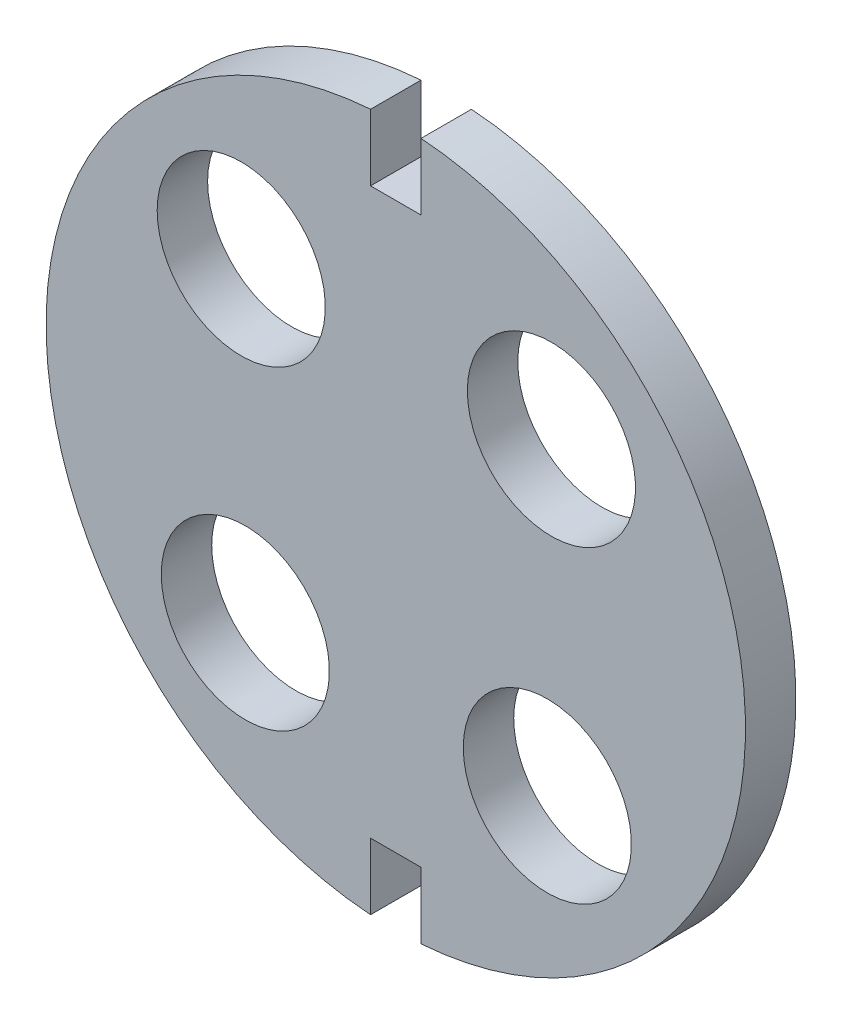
from build123d import *

# Parameters (mm, degrees)
SKETCH1_R          = 26.416
EXTRUDE1_DEPTH     = 3.81
SKETCH2_R          = 6.35
CUT_EXTRUDE1_DEPTH = 38.551647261
SKETCH3_W          = 3.81
SKETCH3_H          = 6.083564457
SKETCH3_H_2        = 6.587446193
CUT_EXTRUDE2_DEPTH = 38.551647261


with BuildPart() as part:
    # Sketch1 → Extrude1 (new body)
    with BuildSketch(Plane.XY):
        with Locations(Location((0, 0, 0), (0, 0, 180))):
            Circle(SKETCH1_R)
    extrude(amount=EXTRUDE1_DEPTH)

    # Sketch2 → Cut-Extrude1 (cut, through all)
    with BuildSketch(Plane.XY):
        with Locations(Location((-11.674332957, 11.674332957, 0), (0, 0, 180))):
            Circle(SKETCH2_R)
        with Locations(Location((11.756888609, 11.591189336, 0), (0, 0, 180))):
            Circle(SKETCH2_R)
        with Locations(Location((11.448903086, -11.895491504, 0), (0, 0, 180))):
            Circle(SKETCH2_R)
        with Locations(Location((-11.364280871, -11.976360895, 0), (0, 0, 180))):
            Circle(SKETCH2_R)
    extrude(amount=CUT_EXTRUDE1_DEPTH, mode=Mode.SUBTRACT)

    # Sketch3 → Cut-Extrude2 (cut, through all)
    with BuildSketch(Plane.XY):
        with Locations((0, 24.377782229)):
            Rectangle(SKETCH3_W, SKETCH3_H)
        with Locations((0, -24.629723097)):
            Rectangle(SKETCH3_W, SKETCH3_H_2)
    extrude(amount=CUT_EXTRUDE2_DEPTH, mode=Mode.SUBTRACT)


solid = part.part
